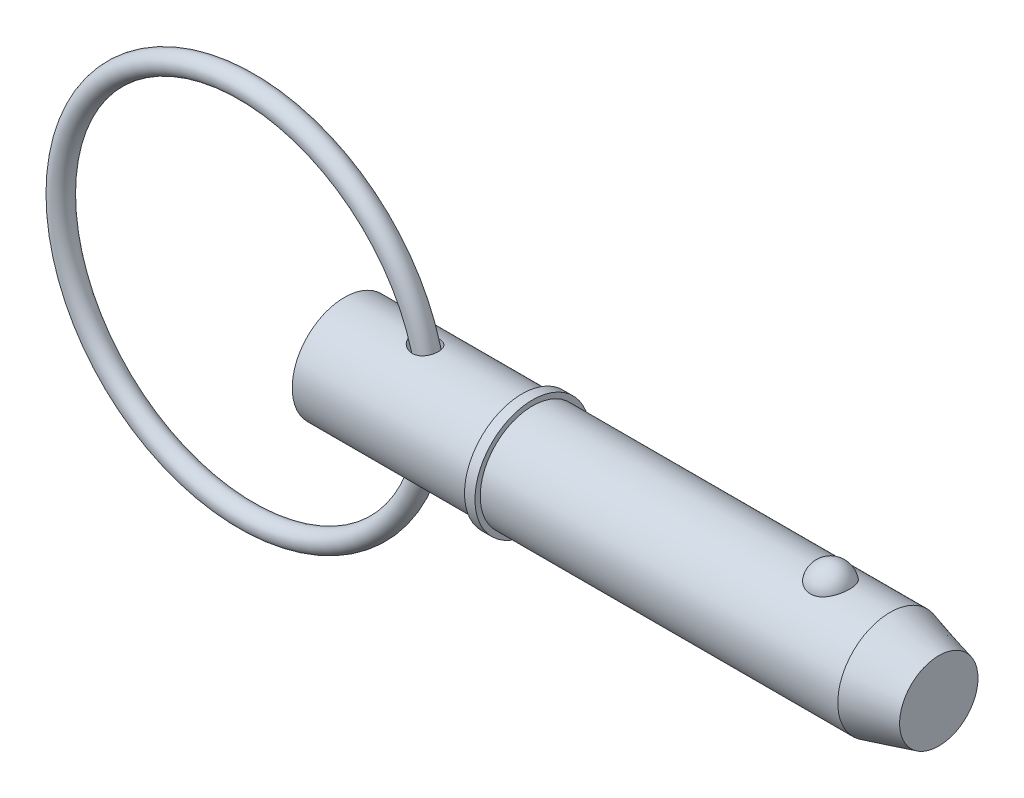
ISO-10303-21;
HEADER;
FILE_DESCRIPTION(('STEP AP214'),'2;1');
FILE_NAME('part.step','',(''),(''),'','','');
FILE_SCHEMA(('AUTOMOTIVE_DESIGN { 1 0 10303 214 1 1 1 1 }'));
ENDSEC;
DATA;
#1=APPLICATION_CONTEXT('core data for automotive mechanical design processes');
#2=APPLICATION_PROTOCOL_DEFINITION('international standard','automotive_design',2000,#1);
#3=PRODUCT_CONTEXT('',#1,'mechanical');
#4=PRODUCT('Part','Part','',(#3));
#5=PRODUCT_RELATED_PRODUCT_CATEGORY('part','',(#4));
#6=PRODUCT_DEFINITION_FORMATION('','',#4);
#7=PRODUCT_DEFINITION_CONTEXT('part definition',#1,'design');
#8=PRODUCT_DEFINITION('design','',#6,#7);
#9=PRODUCT_DEFINITION_SHAPE('','',#8);
#10=(LENGTH_UNIT() NAMED_UNIT(*) SI_UNIT(.MILLI.,.METRE.));
#11=(NAMED_UNIT(*) PLANE_ANGLE_UNIT() SI_UNIT($,.RADIAN.));
#12=(NAMED_UNIT(*) SI_UNIT($,.STERADIAN.) SOLID_ANGLE_UNIT());
#13=UNCERTAINTY_MEASURE_WITH_UNIT(LENGTH_MEASURE(1.E-05),#10,'distance_accuracy_value','');
#14=(GEOMETRIC_REPRESENTATION_CONTEXT(3) GLOBAL_UNCERTAINTY_ASSIGNED_CONTEXT((#13)) GLOBAL_UNIT_ASSIGNED_CONTEXT((#10,
#11,#12)) REPRESENTATION_CONTEXT('',''));
#15=CARTESIAN_POINT('',(0.,0.,0.));
#16=DIRECTION('',(0.,0.,1.));
#17=DIRECTION('',(1.,0.,0.));
#18=AXIS2_PLACEMENT_3D('',#15,#16,#17);
#19=CARTESIAN_POINT('',(-13.3805387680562,0.,0.));
#20=DIRECTION('',(0.,0.,1.));
#21=DIRECTION('',(1.,0.,0.));
#22=AXIS2_PLACEMENT_3D('',#19,#20,#21);
#23=TOROIDAL_SURFACE('',#22,25.4,1.429);
#24=CARTESIAN_POINT('',(13.4484612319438,0.,0.));
#25=VERTEX_POINT('',#24);
#26=VERTEX_LOOP('',#25);
#27=FACE_BOUND('',#26,.T.);
#28=ADVANCED_FACE('P0_F12',(#27),#23,.T.);
#29=CLOSED_SHELL('',(#28));
#30=MANIFOLD_SOLID_BREP('P0_B1',#29);
#31=CARTESIAN_POINT('',(0.,0.,0.));
#32=DIRECTION('',(1.,0.,0.));
#33=DIRECTION('',(0.,0.,-1.));
#34=AXIS2_PLACEMENT_3D('',#31,#32,#33);
#35=CYLINDRICAL_SURFACE('',#34,7.145);
#36=CARTESIAN_POINT('',(9.43029029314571,7.0820748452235,-0.946171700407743));
#37=CARTESIAN_POINT('',(9.49289741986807,7.07004660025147,-1.03619677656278));
#38=CARTESIAN_POINT('',(9.56370593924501,7.05703049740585,-1.12049617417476));
#39=CARTESIAN_POINT('',(9.71869321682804,7.03060933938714,-1.27585605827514));
#40=CARTESIAN_POINT('',(9.80290151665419,7.01720347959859,-1.34688652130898));
#41=CARTESIAN_POINT('',(9.98160385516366,6.99158714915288,-1.47408585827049));
#42=CARTESIAN_POINT('',(10.0760626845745,6.97937284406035,-1.53030346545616));
#43=CARTESIAN_POINT('',(10.2729508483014,6.95747410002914,-1.62697341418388));
#44=CARTESIAN_POINT('',(10.3753769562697,6.9477886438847,-1.66743209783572));
#45=CARTESIAN_POINT('',(10.5898946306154,6.93181594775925,-1.73266776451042));
#46=CARTESIAN_POINT('',(10.7022085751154,6.92567913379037,-1.75675727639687));
#47=CARTESIAN_POINT('',(10.9294935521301,6.91839634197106,-1.78523005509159));
#48=CARTESIAN_POINT('',(11.0444638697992,6.91724903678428,-1.78961856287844));
#49=CARTESIAN_POINT('',(11.2673249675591,6.92023954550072,-1.77801517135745));
#50=CARTESIAN_POINT('',(11.3752729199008,6.9241055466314,-1.7630715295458));
#51=CARTESIAN_POINT('',(11.5865707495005,6.93632220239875,-1.71437618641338));
#52=CARTESIAN_POINT('',(11.6899227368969,6.94467077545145,-1.68063321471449));
#53=CARTESIAN_POINT('',(11.8814537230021,6.96412118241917,-1.59802791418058));
#54=CARTESIAN_POINT('',(11.9701885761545,6.97498839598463,-1.55039425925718));
#55=CARTESIAN_POINT('',(12.1379548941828,6.99847346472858,-1.44066970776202));
#56=CARTESIAN_POINT('',(12.216987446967,7.01109112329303,-1.37858043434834));
#57=CARTESIAN_POINT('',(12.3614636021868,7.03632910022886,-1.24326778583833));
#58=CARTESIAN_POINT('',(12.4271729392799,7.04894297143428,-1.17032635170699));
#59=CARTESIAN_POINT('',(12.5455377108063,7.07306867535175,-1.01436746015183));
#60=CARTESIAN_POINT('',(12.5981928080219,7.08458047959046,-0.931349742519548));
#61=CARTESIAN_POINT('',(12.6896059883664,7.10535787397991,-0.75677050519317));
#62=CARTESIAN_POINT('',(12.7282356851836,7.11460247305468,-0.665139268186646));
#63=CARTESIAN_POINT('',(12.7900431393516,7.12971795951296,-0.476541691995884));
#64=CARTESIAN_POINT('',(12.8132203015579,7.13558871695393,-0.379575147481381));
#65=CARTESIAN_POINT('',(12.843715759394,7.14336270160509,-0.182249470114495));
#66=CARTESIAN_POINT('',(12.8509095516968,7.14523477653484,-0.0818698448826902));
#67=CARTESIAN_POINT('',(12.8489064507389,7.14471772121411,0.11871563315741));
#68=CARTESIAN_POINT('',(12.8397092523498,7.14232851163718,0.218921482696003));
#69=CARTESIAN_POINT('',(12.8051110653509,7.13353949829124,0.416446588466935));
#70=CARTESIAN_POINT('',(12.7796895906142,7.12713462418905,0.51376203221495));
#71=CARTESIAN_POINT('',(12.7132079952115,7.1110024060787,0.702607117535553));
#72=CARTESIAN_POINT('',(12.6721476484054,7.10127501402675,0.794136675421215));
#73=CARTESIAN_POINT('',(12.5754142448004,7.07957648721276,0.9686879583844));
#74=CARTESIAN_POINT('',(12.5197583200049,7.06760798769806,1.05171950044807));
#75=CARTESIAN_POINT('',(12.3951873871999,7.04275315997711,1.20699878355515));
#76=CARTESIAN_POINT('',(12.3262733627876,7.02986689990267,1.27924732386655));
#77=CARTESIAN_POINT('',(12.1775943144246,7.00473797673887,1.41035599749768));
#78=CARTESIAN_POINT('',(12.0979195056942,6.99249102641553,1.46931758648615));
#79=CARTESIAN_POINT('',(11.9295314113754,6.96991222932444,1.57295053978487));
#80=CARTESIAN_POINT('',(11.840819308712,6.9595801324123,1.61762377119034));
#81=CARTESIAN_POINT('',(11.6577653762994,6.94204625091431,1.69128599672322));
#82=CARTESIAN_POINT('',(11.5634812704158,6.93481718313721,1.72041226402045));
#83=CARTESIAN_POINT('',(11.3712731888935,6.92407027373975,1.76316901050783));
#84=CARTESIAN_POINT('',(11.2733489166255,6.92055273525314,1.7767982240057));
#85=CARTESIAN_POINT('',(11.0745092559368,6.91745053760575,1.78883853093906));
#86=CARTESIAN_POINT('',(10.9735737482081,6.91794816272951,1.7869312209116));
#87=CARTESIAN_POINT('',(10.7732766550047,6.92286647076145,1.76777696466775));
#88=CARTESIAN_POINT('',(10.6739155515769,6.92728833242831,1.75052540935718));
#89=CARTESIAN_POINT('',(10.4726907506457,6.93987626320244,1.69995986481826));
#90=CARTESIAN_POINT('',(10.3710860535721,6.94826759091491,1.66567223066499));
#91=CARTESIAN_POINT('',(10.1746512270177,6.96783543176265,1.5818155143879));
#92=CARTESIAN_POINT('',(10.0798244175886,6.97901329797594,1.53223900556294));
#93=CARTESIAN_POINT('',(9.89353725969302,7.00369413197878,1.41530336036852));
#94=CARTESIAN_POINT('',(9.80266896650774,7.01729943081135,1.34701798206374));
#95=CARTESIAN_POINT('',(9.63408859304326,7.0446567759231,1.19571433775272));
#96=CARTESIAN_POINT('',(9.55637809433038,7.05840883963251,1.11269430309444));
#97=CARTESIAN_POINT('',(9.41909992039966,7.083998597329,0.935821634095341));
#98=CARTESIAN_POINT('',(9.3591283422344,7.09587546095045,0.842290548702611));
#99=CARTESIAN_POINT('',(9.25811978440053,7.11649414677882,0.645207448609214));
#100=CARTESIAN_POINT('',(9.2170578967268,7.12524008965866,0.541668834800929));
#101=CARTESIAN_POINT('',(9.16044503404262,7.13745944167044,0.341322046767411));
#102=CARTESIAN_POINT('',(9.14237352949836,7.14144984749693,0.24525723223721));
#103=CARTESIAN_POINT('',(9.12416132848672,7.14547143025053,0.0513577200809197));
#104=CARTESIAN_POINT('',(9.12401221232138,7.14550446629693,-0.0464761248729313));
#105=CARTESIAN_POINT('',(9.14075660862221,7.14180686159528,-0.230866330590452));
#106=CARTESIAN_POINT('',(9.15598246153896,7.13844450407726,-0.317588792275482));
#107=CARTESIAN_POINT('',(9.20015637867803,7.1288735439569,-0.487231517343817));
#108=CARTESIAN_POINT('',(9.22909411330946,7.12266708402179,-0.570154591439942));
#109=CARTESIAN_POINT('',(9.2869632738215,7.11060500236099,-0.702183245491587));
#110=CARTESIAN_POINT('',(9.31233771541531,7.10538970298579,-0.752949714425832));
#111=CARTESIAN_POINT('',(9.36784352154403,7.09422889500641,-0.85170964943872));
#112=CARTESIAN_POINT('',(9.39797435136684,7.08828346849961,-0.899703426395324));
#113=CARTESIAN_POINT('',(9.43029029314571,7.0820748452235,-0.946171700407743));
#114=B_SPLINE_CURVE_WITH_KNOTS('',3,(#36,#37,#38,#39,#40,#41,#42,#43,#44,#45,#46,#47,#48,#49,
#50,#51,#52,#53,#54,#55,#56,#57,#58,#59,#60,#61,#62,#63,#64,#65,#66,#67,#68,#69,#70,#71,#72,#73,
#74,#75,#76,#77,#78,#79,#80,#81,#82,#83,#84,#85,#86,#87,#88,#89,#90,#91,#92,#93,#94,#95,#96,#97,
#98,#99,#100,#101,#102,#103,#104,#105,#106,#107,#108,#109,#110,#111,#112,#113),.UNSPECIFIED.,
.T.,.F.,(4,2,2,2,2,2,2,2,2,2,2,2,2,2,2,2,2,2,2,2,2,2,2,2,2,2,2,2,2,2,2,2,2,2,2,2,2,2,4),(0.,
0.330712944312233,0.662165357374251,0.992513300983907,1.32272815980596,1.66607248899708,
2.00932547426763,2.33472339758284,2.65997034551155,2.96236844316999,3.26473260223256,
3.56029376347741,3.85586255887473,4.15407251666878,4.45229395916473,4.75283038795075,
5.05337241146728,5.35429467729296,5.6552212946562,5.95579625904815,6.25634893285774,
6.55452242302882,6.85265693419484,7.14811357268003,7.44359434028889,7.74514565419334,
8.04678757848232,8.368090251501,8.68954924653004,9.03133562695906,9.37316306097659,
9.70647113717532,10.0393389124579,10.3311793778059,10.6228827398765,10.8860177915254,
11.1489549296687,11.3196783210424,11.4903825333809),.UNSPECIFIED.);
#115=CARTESIAN_POINT('',(9.43029029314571,7.0820748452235,-0.946171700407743));
#116=VERTEX_POINT('',#115);
#117=EDGE_CURVE('P1_E42',#116,#116,#114,.T.);
#118=ORIENTED_EDGE('',*,*,#117,.T.);
#119=EDGE_LOOP('',(#118));
#120=FACE_BOUND('',#119,.T.);
#121=CARTESIAN_POINT('',(0.,0.,0.));
#122=DIRECTION('',(1.,0.,0.));
#123=DIRECTION('',(0.,0.,-1.));
#124=AXIS2_PLACEMENT_3D('',#121,#122,#123);
#125=CIRCLE('',#124,7.145);
#126=CARTESIAN_POINT('',(0.,0.,-7.145));
#127=VERTEX_POINT('',#126);
#128=EDGE_CURVE('P1_E9',#127,#127,#125,.T.);
#129=ORIENTED_EDGE('',*,*,#128,.T.);
#130=EDGE_LOOP('',(#129));
#131=FACE_BOUND('',#130,.T.);
#132=CARTESIAN_POINT('',(24.271,0.,0.));
#133=DIRECTION('',(1.,0.,0.));
#134=DIRECTION('',(0.,0.,-1.));
#135=AXIS2_PLACEMENT_3D('',#132,#133,#134);
#136=CIRCLE('',#135,7.145);
#137=CARTESIAN_POINT('',(24.271,0.,-7.145));
#138=VERTEX_POINT('',#137);
#139=EDGE_CURVE('P1_E25',#138,#138,#136,.T.);
#140=ORIENTED_EDGE('',*,*,#139,.F.);
#141=EDGE_LOOP('',(#140));
#142=FACE_BOUND('',#141,.T.);
#143=CARTESIAN_POINT('',(9.43029029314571,-7.0820748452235,-0.946171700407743));
#144=CARTESIAN_POINT('',(9.37760063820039,-7.09219753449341,-0.870403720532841));
#145=CARTESIAN_POINT('',(9.33068640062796,-7.10162619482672,-0.790535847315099));
#146=CARTESIAN_POINT('',(9.25028000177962,-7.11818229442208,-0.624083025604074));
#147=CARTESIAN_POINT('',(9.21677847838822,-7.12531133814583,-0.537502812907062));
#148=CARTESIAN_POINT('',(9.16475883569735,-7.13651886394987,-0.359324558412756));
#149=CARTESIAN_POINT('',(9.14630423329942,-7.14058440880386,-0.267706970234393));
#150=CARTESIAN_POINT('',(9.12573334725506,-7.14512216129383,-0.0825612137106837));
#151=CARTESIAN_POINT('',(9.12361335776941,-7.1455951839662,0.0109665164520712));
#152=CARTESIAN_POINT('',(9.13548667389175,-7.14296952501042,0.191627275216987));
#153=CARTESIAN_POINT('',(9.14858103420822,-7.14007009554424,0.278824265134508));
#154=CARTESIAN_POINT('',(9.18869656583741,-7.1313430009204,0.449782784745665));
#155=CARTESIAN_POINT('',(9.21571947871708,-7.1255149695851,0.533543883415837));
#156=CARTESIAN_POINT('',(9.282939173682,-7.11140544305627,0.696984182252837));
#157=CARTESIAN_POINT('',(9.32334793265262,-7.10308469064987,0.7765721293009));
#158=CARTESIAN_POINT('',(9.41555290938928,-7.08481187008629,0.928623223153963));
#159=CARTESIAN_POINT('',(9.4673531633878,-7.07485922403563,1.00108383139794));
#160=CARTESIAN_POINT('',(9.58690514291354,-7.05302654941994,1.14530893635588));
#161=CARTESIAN_POINT('',(9.65578345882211,-7.04105486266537,1.21612477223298));
#162=CARTESIAN_POINT('',(9.80342908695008,-7.01727063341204,1.34660507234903));
#163=CARTESIAN_POINT('',(9.88220203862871,-7.00545818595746,1.40626312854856));
#164=CARTESIAN_POINT('',(10.0573217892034,-6.98177399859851,1.51973713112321));
#165=CARTESIAN_POINT('',(10.1546474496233,-6.9700532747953,1.57208037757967));
#166=CARTESIAN_POINT('',(10.3567277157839,-6.94950828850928,1.66055104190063));
#167=CARTESIAN_POINT('',(10.4614845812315,-6.94068491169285,1.69667350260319));
#168=CARTESIAN_POINT('',(10.6792116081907,-6.92685379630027,1.75230777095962));
#169=CARTESIAN_POINT('',(10.7923373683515,-6.92197732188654,1.77125049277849));
#170=CARTESIAN_POINT('',(11.0202699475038,-6.91736328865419,1.78919210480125));
#171=CARTESIAN_POINT('',(11.1350759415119,-6.91762328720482,1.78820047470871));
#172=CARTESIAN_POINT('',(11.355627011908,-6.92328130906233,1.76615765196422));
#173=CARTESIAN_POINT('',(11.4615007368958,-6.92836826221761,1.74632083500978));
#174=CARTESIAN_POINT('',(11.6678083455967,-6.94272508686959,1.68833625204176));
#175=CARTESIAN_POINT('',(11.7682443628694,-6.9519933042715,1.65019572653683));
#176=CARTESIAN_POINT('',(11.9539217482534,-6.97285816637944,1.55957439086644));
#177=CARTESIAN_POINT('',(12.0397280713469,-6.98426147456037,1.50820229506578));
#178=CARTESIAN_POINT('',(12.2011249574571,-7.00842344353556,1.39160266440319));
#179=CARTESIAN_POINT('',(12.276716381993,-7.0211819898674,1.32637629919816));
#180=CARTESIAN_POINT('',(12.4144868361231,-7.04639315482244,1.18508369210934));
#181=CARTESIAN_POINT('',(12.4768620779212,-7.05884739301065,1.10920872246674));
#182=CARTESIAN_POINT('',(12.5881779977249,-7.08230185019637,0.947973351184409));
#183=CARTESIAN_POINT('',(12.6371182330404,-7.09330202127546,0.862612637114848));
#184=CARTESIAN_POINT('',(12.7208404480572,-7.11277016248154,0.68387168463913));
#185=CARTESIAN_POINT('',(12.7554736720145,-7.12121129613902,0.590418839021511));
#186=CARTESIAN_POINT('',(12.8090653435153,-7.13450309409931,0.398877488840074));
#187=CARTESIAN_POINT('',(12.8280232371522,-7.13935363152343,0.300788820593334));
#188=CARTESIAN_POINT('',(12.8499077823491,-7.14496695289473,0.102058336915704));
#189=CARTESIAN_POINT('',(12.8527265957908,-7.14570223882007,0.00140385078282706));
#190=CARTESIAN_POINT('',(12.8419792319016,-7.14293198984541,-0.198968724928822));
#191=CARTESIAN_POINT('',(12.8284127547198,-7.13942637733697,-0.298686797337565));
#192=CARTESIAN_POINT('',(12.7851853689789,-7.12854635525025,-0.494442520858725));
#193=CARTESIAN_POINT('',(12.7555107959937,-7.12116866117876,-0.590476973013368));
#194=CARTESIAN_POINT('',(12.6807437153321,-7.10334272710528,-0.776042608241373));
#195=CARTESIAN_POINT('',(12.6356510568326,-7.09289445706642,-0.865573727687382));
#196=CARTESIAN_POINT('',(12.5312128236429,-7.07009703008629,-1.03541867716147));
#197=CARTESIAN_POINT('',(12.4718917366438,-7.0577511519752,-1.11574799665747));
#198=CARTESIAN_POINT('',(12.3404461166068,-7.03252701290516,-1.26504204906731));
#199=CARTESIAN_POINT('',(12.2683227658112,-7.01964880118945,-1.3340078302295));
#200=CARTESIAN_POINT('',(12.1139052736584,-6.99493588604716,-1.45803732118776));
#201=CARTESIAN_POINT('',(12.031708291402,-6.98309284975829,-1.51322032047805));
#202=CARTESIAN_POINT('',(11.858962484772,-6.96164945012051,-1.60900039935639));
#203=CARTESIAN_POINT('',(11.7684146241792,-6.95204882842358,-1.6495991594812));
#204=CARTESIAN_POINT('',(11.5822744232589,-6.93618392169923,-1.71508374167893));
#205=CARTESIAN_POINT('',(11.4867225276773,-6.92989640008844,-1.74007923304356));
#206=CARTESIAN_POINT('',(11.292703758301,-6.92114809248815,-1.77455680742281));
#207=CARTESIAN_POINT('',(11.1942365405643,-6.91868775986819,-1.7840370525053));
#208=CARTESIAN_POINT('',(10.9943797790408,-6.91771041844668,-1.78782317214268));
#209=CARTESIAN_POINT('',(10.8929824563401,-6.9193005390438,-1.78171679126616));
#210=CARTESIAN_POINT('',(10.6924353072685,-6.92632816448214,-1.75419409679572));
#211=CARTESIAN_POINT('',(10.5932861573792,-6.93176681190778,-1.73277323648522));
#212=CARTESIAN_POINT('',(10.3927770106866,-6.94630717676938,-1.67356884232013));
#213=CARTESIAN_POINT('',(10.2917367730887,-6.95563581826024,-1.63475796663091));
#214=CARTESIAN_POINT('',(10.0971768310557,-6.97681957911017,-1.54184188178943));
#215=CARTESIAN_POINT('',(10.0036623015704,-6.9886764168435,-1.48772626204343));
#216=CARTESIAN_POINT('',(9.82098935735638,-7.01440230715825,-1.36146688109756));
#217=CARTESIAN_POINT('',(9.73247440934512,-7.0283510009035,-1.28840361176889));
#218=CARTESIAN_POINT('',(9.56978695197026,-7.05591334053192,-1.12770855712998));
#219=CARTESIAN_POINT('',(9.49560170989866,-7.06952727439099,-1.0400898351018));
#220=CARTESIAN_POINT('',(9.43029029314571,-7.0820748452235,-0.946171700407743));
#221=B_SPLINE_CURVE_WITH_KNOTS('',3,(#143,#144,#145,#146,#147,#148,#149,#150,#151,#152,#153,
#154,#155,#156,#157,#158,#159,#160,#161,#162,#163,#164,#165,#166,#167,#168,#169,#170,#171,#172,
#173,#174,#175,#176,#177,#178,#179,#180,#181,#182,#183,#184,#185,#186,#187,#188,#189,#190,#191,
#192,#193,#194,#195,#196,#197,#198,#199,#200,#201,#202,#203,#204,#205,#206,#207,#208,#209,#210,
#211,#212,#213,#214,#215,#216,#217,#218,#219,#220),.UNSPECIFIED.,.T.,.F.,(4,2,2,2,2,2,2,2,2,2,2,
2,2,2,2,2,2,2,2,2,2,2,2,2,2,2,2,2,2,2,2,2,2,2,2,2,2,2,4),(0.,0.278197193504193,
0.556199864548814,0.835370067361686,1.11447693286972,1.37789669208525,1.64134939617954,
1.9091912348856,2.17712812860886,2.4744625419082,2.77196719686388,3.10386520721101,
3.43586457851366,3.77849767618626,4.1209678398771,4.44276705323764,4.76443907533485,
5.06494526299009,5.36542609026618,5.6610728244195,5.95672929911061,6.25538683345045,
6.5540549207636,6.85471634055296,7.15538326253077,7.45630563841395,7.75723095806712,
8.05764204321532,8.35802540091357,8.65571107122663,8.95336242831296,9.24889743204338,
9.54446744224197,9.84793560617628,10.1514939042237,10.4760045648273,10.8007364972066,
11.1458836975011,11.4907227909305),.UNSPECIFIED.);
#222=CARTESIAN_POINT('',(9.43029029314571,-7.0820748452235,-0.946171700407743));
#223=VERTEX_POINT('',#222);
#224=EDGE_CURVE('P1_E17',#223,#223,#221,.T.);
#225=ORIENTED_EDGE('',*,*,#224,.T.);
#226=EDGE_LOOP('',(#225));
#227=FACE_BOUND('',#226,.T.);
#228=ADVANCED_FACE('P1_F13',(#120,#131,#142,#227),#35,.T.);
#229=CARTESIAN_POINT('',(0.,0.,0.));
#230=DIRECTION('',(1.,0.,0.));
#231=DIRECTION('',(0.,0.,-1.));
#232=AXIS2_PLACEMENT_3D('',#229,#230,#231);
#233=CYLINDRICAL_SURFACE('',#232,7.145);
#234=CARTESIAN_POINT('',(74.5836242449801,0.,0.));
#235=DIRECTION('',(1.,0.,0.));
#236=DIRECTION('',(0.,0.,-1.));
#237=AXIS2_PLACEMENT_3D('',#234,#235,#236);
#238=CIRCLE('',#237,7.145);
#239=CARTESIAN_POINT('',(74.5836242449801,0.,-7.145));
#240=VERTEX_POINT('',#239);
#241=EDGE_CURVE('P1_E99',#240,#240,#238,.T.);
#242=ORIENTED_EDGE('',*,*,#241,.F.);
#243=EDGE_LOOP('',(#242));
#244=FACE_BOUND('',#243,.T.);
#245=CARTESIAN_POINT('',(25.7,0.,0.));
#246=DIRECTION('',(1.,0.,0.));
#247=DIRECTION('',(0.,0.,-1.));
#248=AXIS2_PLACEMENT_3D('',#245,#246,#247);
#249=CIRCLE('',#248,7.145);
#250=CARTESIAN_POINT('',(25.7,0.,-7.145));
#251=VERTEX_POINT('',#250);
#252=EDGE_CURVE('P1_E96',#251,#251,#249,.T.);
#253=ORIENTED_EDGE('',*,*,#252,.T.);
#254=EDGE_LOOP('',(#253));
#255=FACE_BOUND('',#254,.T.);
#256=CARTESIAN_POINT('',(66.4395037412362,6.60328629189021,2.72903557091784));
#257=CARTESIAN_POINT('',(66.2983158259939,6.60329644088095,2.7290249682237));
#258=CARTESIAN_POINT('',(66.1568832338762,6.60799490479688,2.71772840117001));
#259=CARTESIAN_POINT('',(65.8779557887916,6.62628236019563,2.67281935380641));
#260=CARTESIAN_POINT('',(65.7404726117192,6.63989534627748,2.63914664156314));
#261=CARTESIAN_POINT('',(65.4738894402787,6.67440775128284,2.55059642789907));
#262=CARTESIAN_POINT('',(65.3447683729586,6.69528793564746,2.49577486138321));
#263=CARTESIAN_POINT('',(65.0978694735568,6.74205585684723,2.36651799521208));
#264=CARTESIAN_POINT('',(64.9800865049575,6.76794130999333,2.29209163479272));
#265=CARTESIAN_POINT('',(64.7551671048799,6.82286177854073,2.12312937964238));
#266=CARTESIAN_POINT('',(64.6484405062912,6.85196655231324,2.02807107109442));
#267=CARTESIAN_POINT('',(64.4519181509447,6.90970232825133,1.82167822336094));
#268=CARTESIAN_POINT('',(64.362127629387,6.93833318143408,1.71033867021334));
#269=CARTESIAN_POINT('',(64.1976670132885,6.9935167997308,1.46891951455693));
#270=CARTESIAN_POINT('',(64.123844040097,7.01992110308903,1.33822781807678));
#271=CARTESIAN_POINT('',(63.9980884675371,7.06643385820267,1.06566567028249));
#272=CARTESIAN_POINT('',(63.9461573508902,7.08654188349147,0.923794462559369));
#273=CARTESIAN_POINT('',(63.8647323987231,7.11862399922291,0.630993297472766));
#274=CARTESIAN_POINT('',(63.8355167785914,7.13049704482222,0.479974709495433));
#275=CARTESIAN_POINT('',(63.8011742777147,7.14449484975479,0.174782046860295));
#276=CARTESIAN_POINT('',(63.7960466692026,7.14661990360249,0.0206080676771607));
#277=CARTESIAN_POINT('',(63.809938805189,7.14092465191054,-0.285506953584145));
#278=CARTESIAN_POINT('',(63.8288101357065,7.1331654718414,-0.437455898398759));
#279=CARTESIAN_POINT('',(63.8900622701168,7.10859076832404,-0.735778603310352));
#280=CARTESIAN_POINT('',(63.9324435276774,7.0917750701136,-0.882152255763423));
#281=CARTESIAN_POINT('',(64.0399346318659,7.05076716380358,-1.16543149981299));
#282=CARTESIAN_POINT('',(64.1050759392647,7.02656475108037,-1.30232366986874));
#283=CARTESIAN_POINT('',(64.2567597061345,6.97329145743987,-1.56265907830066));
#284=CARTESIAN_POINT('',(64.343303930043,6.94422017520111,-1.68610120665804));
#285=CARTESIAN_POINT('',(64.5364654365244,6.88415108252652,-1.91671004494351));
#286=CARTESIAN_POINT('',(64.6431807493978,6.85314438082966,-2.02379244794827));
#287=CARTESIAN_POINT('',(64.8739740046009,6.79282069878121,-2.21787433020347));
#288=CARTESIAN_POINT('',(64.9980505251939,6.76350358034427,-2.30487545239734));
#289=CARTESIAN_POINT('',(65.2576784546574,6.71060580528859,-2.45458647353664));
#290=CARTESIAN_POINT('',(65.3929387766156,6.68691885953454,-2.51776240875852));
#291=CARTESIAN_POINT('',(65.6732778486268,6.64741247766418,-2.62030218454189));
#292=CARTESIAN_POINT('',(65.818352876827,6.63159007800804,-2.65967499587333));
#293=CARTESIAN_POINT('',(66.1063475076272,6.61038594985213,-2.71193301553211));
#294=CARTESIAN_POINT('',(66.2490080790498,6.60451880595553,-2.72605165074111));
#295=CARTESIAN_POINT('',(66.5348004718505,6.60240611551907,-2.73116688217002));
#296=CARTESIAN_POINT('',(66.6779321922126,6.60615862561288,-2.7221681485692));
#297=CARTESIAN_POINT('',(66.9558486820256,6.6225609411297,-2.68200435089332));
#298=CARTESIAN_POINT('',(67.0907542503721,6.63492533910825,-2.65154998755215));
#299=CARTESIAN_POINT('',(67.35332009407,6.66687445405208,-2.57015684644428));
#300=CARTESIAN_POINT('',(67.4809797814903,6.68645975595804,-2.51921640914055));
#301=CARTESIAN_POINT('',(67.7285777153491,6.73127274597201,-2.39693610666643));
#302=CARTESIAN_POINT('',(67.848287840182,6.7566138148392,-2.32517694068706));
#303=CARTESIAN_POINT('',(68.0741592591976,6.8100600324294,-2.16363812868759));
#304=CARTESIAN_POINT('',(68.180317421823,6.83816581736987,-2.07385432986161));
#305=CARTESIAN_POINT('',(68.3818620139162,6.89580469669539,-1.87357235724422));
#306=CARTESIAN_POINT('',(68.476440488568,6.92533863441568,-1.76226074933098));
#307=CARTESIAN_POINT('',(68.6463329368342,6.98139526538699,-1.52511696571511));
#308=CARTESIAN_POINT('',(68.7216434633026,7.0079174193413,-1.39928219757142));
#309=CARTESIAN_POINT('',(68.853595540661,7.05607625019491,-1.1321597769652));
#310=CARTESIAN_POINT('',(68.9095688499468,7.07753119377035,-0.990508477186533));
#311=CARTESIAN_POINT('',(68.9982965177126,7.11222355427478,-0.699154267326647));
#312=CARTESIAN_POINT('',(69.0310506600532,7.12546089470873,-0.549451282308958));
#313=CARTESIAN_POINT('',(69.0726899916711,7.1423758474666,-0.246120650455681));
#314=CARTESIAN_POINT('',(69.081558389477,7.14604673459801,-0.0924903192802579));
#315=CARTESIAN_POINT('',(69.0751940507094,7.14343510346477,0.214181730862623));
#316=CARTESIAN_POINT('',(69.0599618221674,7.13715279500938,0.367223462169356));
#317=CARTESIAN_POINT('',(69.0058451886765,7.1153294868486,0.66759501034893));
#318=CARTESIAN_POINT('',(68.9670776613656,7.09983424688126,0.814949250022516));
#319=CARTESIAN_POINT('',(68.8667700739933,7.06119140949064,1.10063221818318));
#320=CARTESIAN_POINT('',(68.8052284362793,7.03804328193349,1.238960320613));
#321=CARTESIAN_POINT('',(68.6602071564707,6.98632429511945,1.50352300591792));
#322=CARTESIAN_POINT('',(68.5766067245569,6.95772382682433,1.62968561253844));
#323=CARTESIAN_POINT('',(68.3893804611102,6.89823072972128,1.86554304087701));
#324=CARTESIAN_POINT('',(68.2857557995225,6.86733823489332,1.97523882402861));
#325=CARTESIAN_POINT('',(68.0610769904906,6.80676456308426,2.17482293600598));
#326=CARTESIAN_POINT('',(67.9400673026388,6.7770805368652,2.26476035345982));
#327=CARTESIAN_POINT('',(67.6833408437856,6.7223050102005,2.42252989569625));
#328=CARTESIAN_POINT('',(67.54761851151,6.69721525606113,2.49035362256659));
#329=CARTESIAN_POINT('',(67.2704022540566,6.65552591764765,2.59967646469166));
#330=CARTESIAN_POINT('',(67.1292810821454,6.63865794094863,2.64202017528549));
#331=CARTESIAN_POINT('',(66.8414448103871,6.61425039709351,2.7025584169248));
#332=CARTESIAN_POINT('',(66.6947480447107,6.606682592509,2.72082606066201));
#333=CARTESIAN_POINT('',(66.5116799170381,6.60358754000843,2.72830331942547));
#334=CARTESIAN_POINT('',(66.4755998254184,6.60328369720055,2.72903828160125));
#335=CARTESIAN_POINT('',(66.4395037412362,6.60328629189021,2.72903557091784));
#336=B_SPLINE_CURVE_WITH_KNOTS('',3,(#256,#257,#258,#259,#260,#261,#262,#263,#264,#265,#266,
#267,#268,#269,#270,#271,#272,#273,#274,#275,#276,#277,#278,#279,#280,#281,#282,#283,#284,#285,
#286,#287,#288,#289,#290,#291,#292,#293,#294,#295,#296,#297,#298,#299,#300,#301,#302,#303,#304,
#305,#306,#307,#308,#309,#310,#311,#312,#313,#314,#315,#316,#317,#318,#319,#320,#321,#322,#323,
#324,#325,#326,#327,#328,#329,#330,#331,#332,#333,#334,#335),.UNSPECIFIED.,.T.,.F.,(4,2,2,2,2,2,
2,2,2,2,2,2,2,2,2,2,2,2,2,2,2,2,2,2,2,2,2,2,2,2,2,2,2,2,2,2,2,2,2,4),(0.,0.423468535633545,
0.848081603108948,1.27157926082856,1.69488414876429,2.13051395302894,2.56627819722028,
3.02136706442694,3.47648674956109,3.93709649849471,4.39769233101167,4.85545355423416,
5.31322361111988,5.77162895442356,6.23007210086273,6.69080337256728,7.15149693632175,
7.60264329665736,8.05361952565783,8.4818972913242,8.91008854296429,9.32472524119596,
9.73939553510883,10.1630783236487,10.5868588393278,11.0319070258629,11.4770347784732,
11.9362874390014,12.3955443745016,12.8551240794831,13.3146940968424,13.7720003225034,
14.2293382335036,14.6892343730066,15.1491036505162,15.6078171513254,16.0667046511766,
16.5093965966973,16.9507410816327,17.0590049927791),.UNSPECIFIED.);
#337=CARTESIAN_POINT('',(66.4395037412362,6.60328629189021,2.72903557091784));
#338=VERTEX_POINT('',#337);
#339=EDGE_CURVE('P1_E34',#338,#338,#336,.T.);
#340=ORIENTED_EDGE('',*,*,#339,.T.);
#341=EDGE_LOOP('',(#340));
#342=FACE_BOUND('',#341,.T.);
#343=ADVANCED_FACE('P1_F46',(#244,#255,#342),#233,.T.);
#344=CARTESIAN_POINT('',(0.,0.,0.));
#345=DIRECTION('',(-1.,0.,0.));
#346=DIRECTION('',(0.,0.,1.));
#347=AXIS2_PLACEMENT_3D('',#344,#345,#346);
#348=PLANE('',#347);
#349=ORIENTED_EDGE('',*,*,#128,.F.);
#350=EDGE_LOOP('',(#349));
#351=FACE_BOUND('',#350,.T.);
#352=ADVANCED_FACE('P1_F15',(#351),#348,.T.);
#353=CARTESIAN_POINT('',(24.271,7.145,0.));
#354=DIRECTION('',(-1.,0.,0.));
#355=DIRECTION('',(0.,0.,1.));
#356=AXIS2_PLACEMENT_3D('',#353,#354,#355);
#357=PLANE('',#356);
#358=ORIENTED_EDGE('',*,*,#139,.T.);
#359=EDGE_LOOP('',(#358));
#360=FACE_BOUND('',#359,.T.);
#361=CARTESIAN_POINT('',(24.271,0.,0.));
#362=DIRECTION('',(1.,0.,0.));
#363=DIRECTION('',(0.,0.,-1.));
#364=AXIS2_PLACEMENT_3D('',#361,#362,#363);
#365=CIRCLE('',#364,7.8595);
#366=CARTESIAN_POINT('',(24.271,0.,-7.8595));
#367=VERTEX_POINT('',#366);
#368=EDGE_CURVE('P1_E30',#367,#367,#365,.T.);
#369=ORIENTED_EDGE('',*,*,#368,.F.);
#370=EDGE_LOOP('',(#369));
#371=FACE_BOUND('',#370,.T.);
#372=ADVANCED_FACE('P1_F81',(#360,#371),#357,.T.);
#373=CARTESIAN_POINT('',(0.,0.,0.));
#374=DIRECTION('',(1.,0.,0.));
#375=DIRECTION('',(0.,0.,-1.));
#376=AXIS2_PLACEMENT_3D('',#373,#374,#375);
#377=CYLINDRICAL_SURFACE('',#376,7.8595);
#378=ORIENTED_EDGE('',*,*,#368,.T.);
#379=EDGE_LOOP('',(#378));
#380=FACE_BOUND('',#379,.T.);
#381=CARTESIAN_POINT('',(25.7,0.,0.));
#382=DIRECTION('',(1.,0.,0.));
#383=DIRECTION('',(0.,0.,-1.));
#384=AXIS2_PLACEMENT_3D('',#381,#382,#383);
#385=CIRCLE('',#384,7.8595);
#386=CARTESIAN_POINT('',(25.7,0.,-7.8595));
#387=VERTEX_POINT('',#386);
#388=EDGE_CURVE('P1_E95',#387,#387,#385,.T.);
#389=ORIENTED_EDGE('',*,*,#388,.F.);
#390=EDGE_LOOP('',(#389));
#391=FACE_BOUND('',#390,.T.);
#392=ADVANCED_FACE('P1_F68',(#380,#391),#377,.T.);
#393=CARTESIAN_POINT('',(25.7,7.8595,0.));
#394=DIRECTION('',(1.,0.,0.));
#395=DIRECTION('',(0.,0.,-1.));
#396=AXIS2_PLACEMENT_3D('',#393,#394,#395);
#397=PLANE('',#396);
#398=ORIENTED_EDGE('',*,*,#388,.T.);
#399=EDGE_LOOP('',(#398));
#400=FACE_BOUND('',#399,.T.);
#401=ORIENTED_EDGE('',*,*,#252,.F.);
#402=EDGE_LOOP('',(#401));
#403=FACE_BOUND('',#402,.T.);
#404=ADVANCED_FACE('P1_F62',(#400,#403),#397,.T.);
#405=CARTESIAN_POINT('',(81.25,0.,0.));
#406=DIRECTION('',(-1.,0.,0.));
#407=DIRECTION('',(0.,0.,1.));
#408=AXIS2_PLACEMENT_3D('',#405,#406,#407);
#409=CONICAL_SURFACE('',#408,5.35875000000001,0.26179938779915);
#410=ORIENTED_EDGE('',*,*,#241,.T.);
#411=EDGE_LOOP('',(#410));
#412=FACE_BOUND('',#411,.T.);
#413=CARTESIAN_POINT('',(81.25,0.,0.));
#414=DIRECTION('',(1.,0.,0.));
#415=DIRECTION('',(0.,0.,-1.));
#416=AXIS2_PLACEMENT_3D('',#413,#414,#415);
#417=CIRCLE('',#416,5.35875000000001);
#418=CARTESIAN_POINT('',(81.25,0.,-5.35875000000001));
#419=VERTEX_POINT('',#418);
#420=EDGE_CURVE('P1_E41',#419,#419,#417,.T.);
#421=ORIENTED_EDGE('',*,*,#420,.F.);
#422=EDGE_LOOP('',(#421));
#423=FACE_BOUND('',#422,.T.);
#424=ADVANCED_FACE('P1_F59',(#412,#423),#409,.T.);
#425=CARTESIAN_POINT('',(81.25,5.35875000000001,0.));
#426=DIRECTION('',(1.,0.,0.));
#427=DIRECTION('',(0.,0.,-1.));
#428=AXIS2_PLACEMENT_3D('',#425,#426,#427);
#429=PLANE('',#428);
#430=ORIENTED_EDGE('',*,*,#420,.T.);
#431=EDGE_LOOP('',(#430));
#432=FACE_BOUND('',#431,.T.);
#433=ADVANCED_FACE('P1_F55',(#432),#429,.T.);
#434=CARTESIAN_POINT('',(66.4395037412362,6.4305,0.));
#435=DIRECTION('',(-1.,0.,0.));
#436=DIRECTION('',(0.,1.,0.));
#437=AXIS2_PLACEMENT_3D('',#434,#435,#436);
#438=SPHERICAL_SURFACE('',#437,2.7345);
#439=ORIENTED_EDGE('',*,*,#339,.F.);
#440=EDGE_LOOP('',(#439));
#441=FACE_BOUND('',#440,.T.);
#442=ADVANCED_FACE('P1_F50',(#441),#438,.T.);
#443=CARTESIAN_POINT('',(-13.3805387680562,0.,0.));
#444=DIRECTION('',(0.,0.,1.));
#445=DIRECTION('',(1.,0.,0.));
#446=AXIS2_PLACEMENT_3D('',#443,#444,#445);
#447=TOROIDAL_SURFACE('',#446,25.4,1.78625);
#448=ORIENTED_EDGE('',*,*,#224,.F.);
#449=EDGE_LOOP('',(#448));
#450=FACE_BOUND('',#449,.T.);
#451=ORIENTED_EDGE('',*,*,#117,.F.);
#452=EDGE_LOOP('',(#451));
#453=FACE_BOUND('',#452,.T.);
#454=ADVANCED_FACE('P1_F54',(#450,#453),#447,.F.);
#455=CLOSED_SHELL('',(#228,#343,#352,#372,#392,#404,#424,#433,#442,#454));
#456=MANIFOLD_SOLID_BREP('P1_B1',#455);
#457=ADVANCED_BREP_SHAPE_REPRESENTATION('',(#18,#30,#456),#14);
#458=SHAPE_DEFINITION_REPRESENTATION(#9,#457);
ENDSEC;
END-ISO-10303-21;
